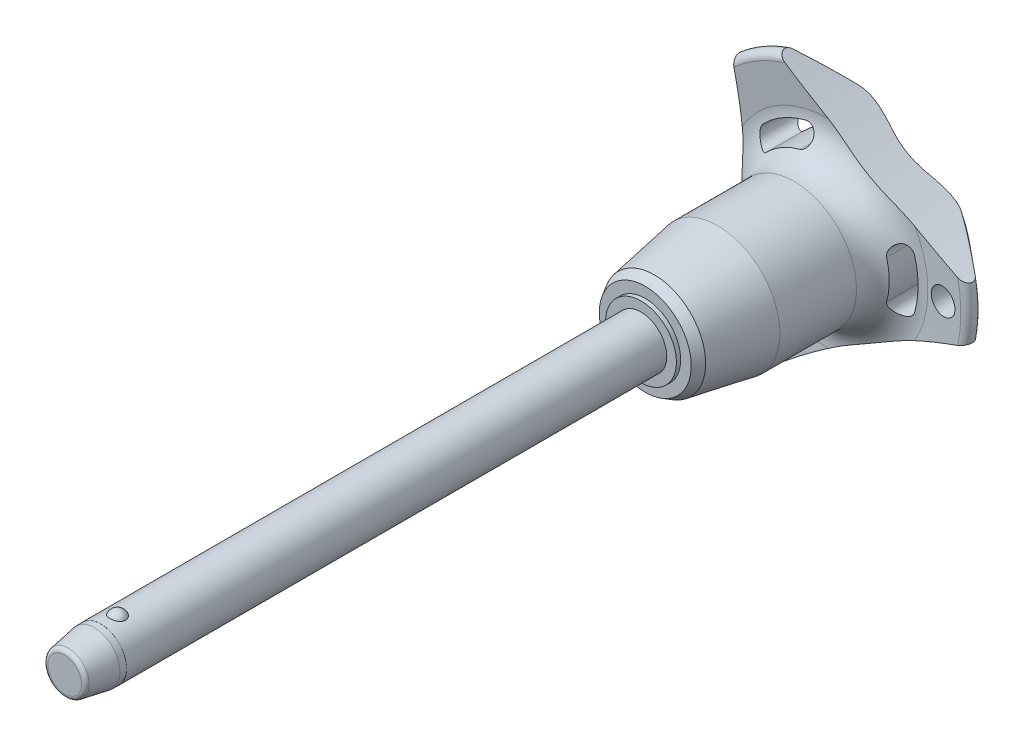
from build123d import *

# Parameters (mm, degrees)
SKETCH1_R           = 3
BOSS_EXTRUDE1_DEPTH = 60
SKETCH2_R           = 2.5
BOSS_EXTRUDE2_DEPTH = 26.7
BOSS_EXTRUDE3_START = 7
SKETCH1_2_R         = 3
BOSS_EXTRUDE3_DEPTH = 7
CHAMFER1_SIZE       = 3.5
CHAMFER1_SIZE2      = 0.617144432
FILLET1_R           = 0.5
SKETCH6_R           = 79.96
CUT_EXTRUDE1_DEPTH  = 90.822819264
CIRPATTERN1_COUNT   = 3
SKETCH7_R           = 1.5
CUT_EXTRUDE2_DEPTH  = 90.653203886
SKETCH8_R           = 3
SKETCH8_R_2         = 2.99
CUT_EXTRUDE3_DEPTH  = 4.2


with BuildPart() as part:
    # Sketch1 → Boss-Extrude1 (new body)
    with BuildSketch(Plane.XY):
        Circle(SKETCH1_R)
    extrude(amount=-BOSS_EXTRUDE1_DEPTH)

    # Sketch2 → Boss-Extrude2 (add)
    with BuildSketch(Plane(origin=(0, 0, -60), x_dir=(-1, 0, 0), z_dir=(0, 0, -1))):
        Circle(SKETCH2_R)
    extrude(amount=BOSS_EXTRUDE2_DEPTH)

    # Sketch3 → Revolve1 (revolve)
    with BuildSketch(Plane(origin=(0, 0, 0), x_dir=(0, 0, -1), z_dir=(1, 0, 0))):
        with BuildLine():
            Line((-0.866025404, 3.5), (-0.866025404, 1.5))
            ThreePointArc((-0.866025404, 1.5), (0.133974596, 2.5), (-0.866025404, 3.5))
        make_face()
        with BuildLine():
            Line((-0.866025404, -1.5), (-0.866025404, -3.5))
            ThreePointArc((-0.866025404, -3.5), (0.133974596, -2.5), (-0.866025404, -1.5))
        make_face()
    revolve(axis=Axis((0, -1.5, 0.866025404), (0, 1, 0)))

    # Sketch1_2 → Boss-Extrude3 (add)
    with BuildSketch(Plane.XY.offset(BOSS_EXTRUDE3_START)):
        Circle(SKETCH1_2_R)
    extrude(amount=-BOSS_EXTRUDE3_DEPTH)

    # Chamfer1
    chamfer1_edges = [part.edges().sort_by_distance(p)[0] for p in [
        (-3, 0, 7),
    ]]
    chamfer1_side = [part.faces().sort_by_distance(p)[0] for p in [
        (-3, 0, -26.5),
    ]]
    chamfer(chamfer1_edges, length=CHAMFER1_SIZE, length2=CHAMFER1_SIZE2, reference=chamfer1_side[0])

    # Fillet1
    fillet1_edges = [part.edges().sort_by_distance(p)[0] for p in [
        (-2.382855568, 0, 7),
        (2.5, 0, -86.7),
    ]]
    fillet(fillet1_edges, radius=FILLET1_R)

    # Sketch4 → Revolve2 (revolve)
    with BuildSketch(Plane(origin=(0, 0, 0), x_dir=(0, 0, -1), z_dir=(1, 0, 0)), mode=Mode.PRIVATE) as revolve2_sk:
        Polygon((60, 0), (60, 4.118359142), (60.5, 4.118359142), (60.5, 5.343400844), (61.560917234, 5.955921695), (68.9, 7.25), (77.8, 7.25), (77.8, 0), align=None)
    revolve(revolve2_sk.sketch.rotate(Axis((0, 0, -77.8), (0, 0, 1)), 90), axis=Axis((0, 0, -77.8), (0, 0, 1)))

    # Sketch5 → Revolve3 (revolve)
    with BuildSketch(Plane(origin=(0, 0, 0), x_dir=(0, 0, -1), z_dir=(1, 0, 0)), mode=Mode.PRIVATE) as revolve3_sk:
        with BuildLine():
            Line((81.78715932, 11.570250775), (81.452568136, 15.735949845))
            ThreePointArc((81.452568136, 15.735949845), (81.946485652, 16.540188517), (82.862835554, 16.314230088))
            Line((82.862835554, 16.314230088), (86.326414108, 12.186497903))
            ThreePointArc((86.326414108, 12.186497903), (86.7, 11.109282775), (86.261488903, 10.056825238))
            ThreePointArc((86.261488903, 10.056825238), (83.289873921, 5.413681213), (82.25, 0))
            Line((82.25, 0), (77.8, 0))
            Line((77.8, 0), (77.8, 7.25))
            ThreePointArc((77.8, 7.25), (80.739473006, 8.537160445), (81.78715932, 11.570250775))
        make_face()
    revolve(revolve3_sk.sketch.rotate(Axis((0, 0, -82.25), (0, 0, 1)), 90), axis=Axis((0, 0, -82.25), (0, 0, 1)))

    # Sketch6 → Cut-Extrude1 (cut, through all)
    with BuildSketch(Plane.XY):
        with Locations((-89.76, 0)):
            Circle(SKETCH6_R)
        with BuildLine():
            ThreePointArc((10.099921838, -2.834717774), (10.490188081, 0), (10.099921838, 2.834717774))
            ThreePointArc((10.099921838, 2.834717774), (8.768180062, 3.582738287), (8.020159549, 2.250996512))
            ThreePointArc((8.020159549, 2.250996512), (8.330062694, 0), (8.020159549, -2.250996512))
            ThreePointArc((8.020159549, -2.250996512), (8.768180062, -3.582738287), (10.099921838, -2.834717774))
        make_face()
    cut_extrude1 = extrude(amount=-CUT_EXTRUDE1_DEPTH, mode=Mode.SUBTRACT)

    # CirPattern1: Cut-Extrude1 ×3 about axis
    cirpattern1_axis = Axis((0, 0, 0), (0, 0, 1))
    for i in range(1, CIRPATTERN1_COUNT):
        add(cut_extrude1.rotate(cirpattern1_axis, i * 360 / CIRPATTERN1_COUNT), mode=Mode.SUBTRACT)

    # Sketch7 → Cut-Extrude2 (cut, through all)
    with BuildSketch(Plane.XY):
        with Locations(Location((13.490188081, 0, 0), (0, 0, 225.221865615))):
            Circle(SKETCH7_R)
    extrude(amount=-CUT_EXTRUDE2_DEPTH, mode=Mode.SUBTRACT)

    # Sketch8 → Cut-Extrude3 (cut)
    with BuildSketch(Plane.XY.offset(7)):
        Circle(SKETCH8_R)
        Circle(SKETCH8_R_2, mode=Mode.SUBTRACT)
    extrude(amount=-CUT_EXTRUDE3_DEPTH, mode=Mode.SUBTRACT)


solid = part.part
